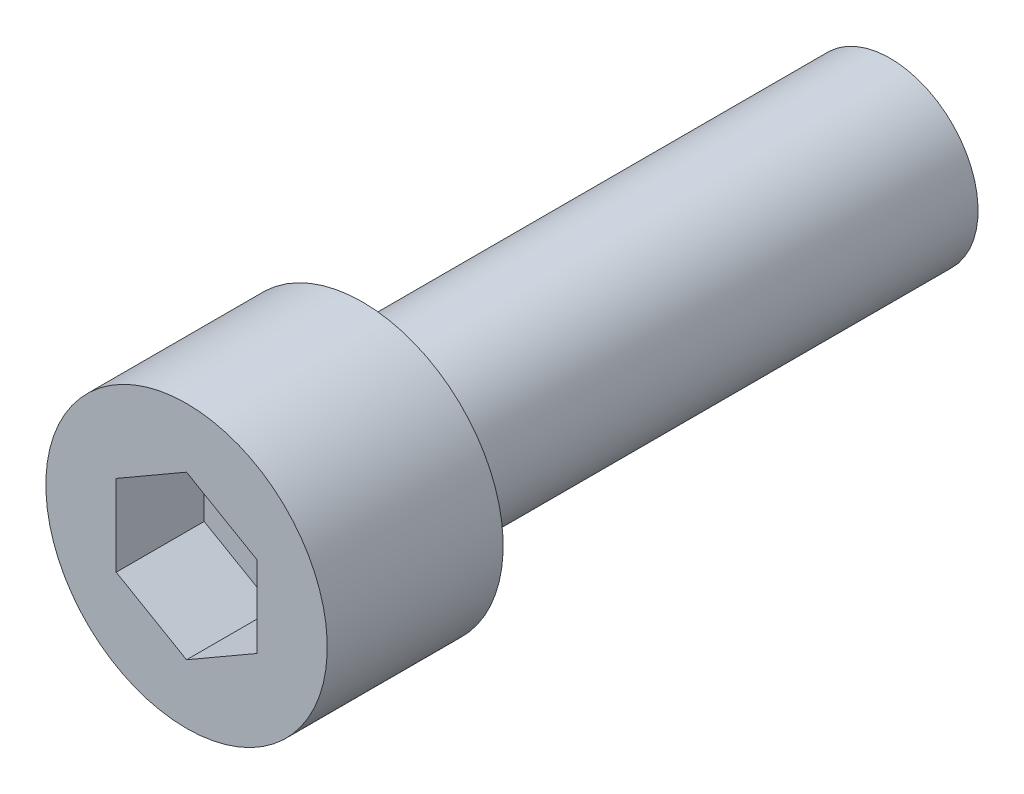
ISO-10303-21;
HEADER;
FILE_DESCRIPTION(('STEP AP214'),'2;1');
FILE_NAME('part.step','',(''),(''),'','','');
FILE_SCHEMA(('AUTOMOTIVE_DESIGN { 1 0 10303 214 1 1 1 1 }'));
ENDSEC;
DATA;
#1=APPLICATION_CONTEXT('core data for automotive mechanical design processes');
#2=APPLICATION_PROTOCOL_DEFINITION('international standard','automotive_design',2000,#1);
#3=PRODUCT_CONTEXT('',#1,'mechanical');
#4=PRODUCT('Part','Part','',(#3));
#5=PRODUCT_RELATED_PRODUCT_CATEGORY('part','',(#4));
#6=PRODUCT_DEFINITION_FORMATION('','',#4);
#7=PRODUCT_DEFINITION_CONTEXT('part definition',#1,'design');
#8=PRODUCT_DEFINITION('design','',#6,#7);
#9=PRODUCT_DEFINITION_SHAPE('','',#8);
#10=(LENGTH_UNIT() NAMED_UNIT(*) SI_UNIT(.MILLI.,.METRE.));
#11=(NAMED_UNIT(*) PLANE_ANGLE_UNIT() SI_UNIT($,.RADIAN.));
#12=(NAMED_UNIT(*) SI_UNIT($,.STERADIAN.) SOLID_ANGLE_UNIT());
#13=UNCERTAINTY_MEASURE_WITH_UNIT(LENGTH_MEASURE(1.E-05),#10,'distance_accuracy_value','');
#14=(GEOMETRIC_REPRESENTATION_CONTEXT(3) GLOBAL_UNCERTAINTY_ASSIGNED_CONTEXT((#13)) GLOBAL_UNIT_ASSIGNED_CONTEXT((#10,
#11,#12)) REPRESENTATION_CONTEXT('',''));
#15=CARTESIAN_POINT('',(0.,0.,0.));
#16=DIRECTION('',(0.,0.,1.));
#17=DIRECTION('',(1.,0.,0.));
#18=AXIS2_PLACEMENT_3D('',#15,#16,#17);
#19=CARTESIAN_POINT('',(0.,0.,0.));
#20=DIRECTION('',(0.,0.,-1.));
#21=DIRECTION('',(0.866025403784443,0.499999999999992,0.));
#22=AXIS2_PLACEMENT_3D('',#19,#20,#21);
#23=CYLINDRICAL_SURFACE('',#22,5.);
#24=CARTESIAN_POINT('',(0.,0.,0.));
#25=DIRECTION('',(0.,0.,1.));
#26=DIRECTION('',(-0.866025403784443,-0.499999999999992,0.));
#27=AXIS2_PLACEMENT_3D('',#24,#25,#26);
#28=CIRCLE('',#27,5.);
#29=CARTESIAN_POINT('',(-4.33012701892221,-2.49999999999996,0.));
#30=VERTEX_POINT('',#29);
#31=EDGE_CURVE('E9',#30,#30,#28,.T.);
#32=ORIENTED_EDGE('',*,*,#31,.F.);
#33=EDGE_LOOP('',(#32));
#34=FACE_BOUND('',#33,.T.);
#35=CARTESIAN_POINT('',(0.,0.,-30.));
#36=DIRECTION('',(0.,0.,1.));
#37=DIRECTION('',(-0.866025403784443,-0.499999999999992,0.));
#38=AXIS2_PLACEMENT_3D('',#35,#36,#37);
#39=CIRCLE('',#38,5.);
#40=CARTESIAN_POINT('',(-4.33012701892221,-2.49999999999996,-30.));
#41=VERTEX_POINT('',#40);
#42=EDGE_CURVE('E22',#41,#41,#39,.T.);
#43=ORIENTED_EDGE('',*,*,#42,.T.);
#44=EDGE_LOOP('',(#43));
#45=FACE_BOUND('',#44,.T.);
#46=ADVANCED_FACE('F15',(#34,#45),#23,.T.);
#47=CARTESIAN_POINT('',(0.,0.,-30.));
#48=DIRECTION('',(0.,0.,1.));
#49=DIRECTION('',(-0.866025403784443,-0.499999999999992,0.));
#50=AXIS2_PLACEMENT_3D('',#47,#48,#49);
#51=PLANE('',#50);
#52=ORIENTED_EDGE('',*,*,#42,.F.);
#53=EDGE_LOOP('',(#52));
#54=FACE_BOUND('',#53,.T.);
#55=ADVANCED_FACE('F132',(#54),#51,.F.);
#56=CARTESIAN_POINT('',(0.,0.,0.));
#57=DIRECTION('',(0.,0.,1.));
#58=DIRECTION('',(-0.866025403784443,-0.499999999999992,0.));
#59=AXIS2_PLACEMENT_3D('',#56,#57,#58);
#60=PLANE('',#59);
#61=CARTESIAN_POINT('',(0.,0.,0.));
#62=DIRECTION('',(0.,0.,1.));
#63=DIRECTION('',(-0.866025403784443,-0.499999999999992,0.));
#64=AXIS2_PLACEMENT_3D('',#61,#62,#63);
#65=CIRCLE('',#64,8.);
#66=CARTESIAN_POINT('',(-6.92820323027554,-3.99999999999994,0.));
#67=VERTEX_POINT('',#66);
#68=EDGE_CURVE('E117',#67,#67,#65,.T.);
#69=ORIENTED_EDGE('',*,*,#68,.F.);
#70=EDGE_LOOP('',(#69));
#71=FACE_BOUND('',#70,.T.);
#72=ORIENTED_EDGE('',*,*,#31,.T.);
#73=EDGE_LOOP('',(#72));
#74=FACE_BOUND('',#73,.T.);
#75=ADVANCED_FACE('F134',(#71,#74),#60,.F.);
#76=CARTESIAN_POINT('',(0.,0.,10.));
#77=DIRECTION('',(0.,0.,-1.));
#78=DIRECTION('',(0.866025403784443,0.499999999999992,0.));
#79=AXIS2_PLACEMENT_3D('',#76,#77,#78);
#80=CYLINDRICAL_SURFACE('',#79,8.);
#81=CARTESIAN_POINT('',(0.,0.,10.));
#82=DIRECTION('',(0.,0.,1.));
#83=DIRECTION('',(-0.866025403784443,-0.499999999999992,0.));
#84=AXIS2_PLACEMENT_3D('',#81,#82,#83);
#85=CIRCLE('',#84,8.);
#86=CARTESIAN_POINT('',(-6.92820323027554,-3.99999999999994,10.));
#87=VERTEX_POINT('',#86);
#88=EDGE_CURVE('E126',#87,#87,#85,.T.);
#89=ORIENTED_EDGE('',*,*,#88,.F.);
#90=EDGE_LOOP('',(#89));
#91=FACE_BOUND('',#90,.T.);
#92=ORIENTED_EDGE('',*,*,#68,.T.);
#93=EDGE_LOOP('',(#92));
#94=FACE_BOUND('',#93,.T.);
#95=ADVANCED_FACE('F141',(#91,#94),#80,.T.);
#96=CARTESIAN_POINT('',(0.,0.,10.));
#97=DIRECTION('',(0.,0.,1.));
#98=DIRECTION('',(-0.866025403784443,-0.499999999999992,0.));
#99=AXIS2_PLACEMENT_3D('',#96,#97,#98);
#100=PLANE('',#99);
#101=DIRECTION('',(0.,-1.,0.));
#102=VECTOR('',#101,1.);
#103=CARTESIAN_POINT('',(-4.,2.30940107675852,10.));
#104=LINE('',#103,#102);
#105=CARTESIAN_POINT('',(-4.,2.30940107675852,10.));
#106=VERTEX_POINT('',#105);
#107=CARTESIAN_POINT('',(-4.,-2.30940107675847,10.));
#108=VERTEX_POINT('',#107);
#109=EDGE_CURVE('E29',#106,#108,#104,.T.);
#110=ORIENTED_EDGE('',*,*,#109,.F.);
#111=DIRECTION('',(-0.86602540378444,-0.5,0.));
#112=VECTOR('',#111,1.);
#113=CARTESIAN_POINT('',(0.,4.61880215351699,10.));
#114=LINE('',#113,#112);
#115=CARTESIAN_POINT('',(0.,4.61880215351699,10.));
#116=VERTEX_POINT('',#115);
#117=EDGE_CURVE('E99',#116,#106,#114,.T.);
#118=ORIENTED_EDGE('',*,*,#117,.F.);
#119=DIRECTION('',(-0.866025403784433,0.5,0.));
#120=VECTOR('',#119,1.);
#121=CARTESIAN_POINT('',(4.,2.30940107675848,10.));
#122=LINE('',#121,#120);
#123=CARTESIAN_POINT('',(4.,2.30940107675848,10.));
#124=VERTEX_POINT('',#123);
#125=EDGE_CURVE('E93',#124,#116,#122,.T.);
#126=ORIENTED_EDGE('',*,*,#125,.F.);
#127=DIRECTION('',(0.,1.,0.));
#128=VECTOR('',#127,1.);
#129=CARTESIAN_POINT('',(4.,-2.30940107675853,10.));
#130=LINE('',#129,#128);
#131=CARTESIAN_POINT('',(4.,-2.30940107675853,10.));
#132=VERTEX_POINT('',#131);
#133=EDGE_CURVE('E91',#132,#124,#130,.T.);
#134=ORIENTED_EDGE('',*,*,#133,.F.);
#135=DIRECTION('',(0.86602540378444,0.5,0.));
#136=VECTOR('',#135,1.);
#137=CARTESIAN_POINT('',(0.,-4.61880215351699,10.));
#138=LINE('',#137,#136);
#139=CARTESIAN_POINT('',(0.,-4.61880215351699,10.));
#140=VERTEX_POINT('',#139);
#141=EDGE_CURVE('E72',#140,#132,#138,.T.);
#142=ORIENTED_EDGE('',*,*,#141,.F.);
#143=DIRECTION('',(0.866025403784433,-0.5,0.));
#144=VECTOR('',#143,1.);
#145=CARTESIAN_POINT('',(-4.,-2.30940107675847,10.));
#146=LINE('',#145,#144);
#147=EDGE_CURVE('E83',#108,#140,#146,.T.);
#148=ORIENTED_EDGE('',*,*,#147,.F.);
#149=EDGE_LOOP('',(#110,#118,#126,#134,#142,#148));
#150=FACE_BOUND('',#149,.T.);
#151=ORIENTED_EDGE('',*,*,#88,.T.);
#152=EDGE_LOOP('',(#151));
#153=FACE_BOUND('',#152,.T.);
#154=ADVANCED_FACE('F87',(#150,#153),#100,.T.);
#155=CARTESIAN_POINT('',(-4.,2.30940107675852,5.));
#156=DIRECTION('',(-1.,0.,0.));
#157=DIRECTION('',(0.,-1.,0.));
#158=AXIS2_PLACEMENT_3D('',#155,#156,#157);
#159=PLANE('',#158);
#160=ORIENTED_EDGE('',*,*,#109,.T.);
#161=DIRECTION('',(0.,0.,1.));
#162=VECTOR('',#161,1.);
#163=CARTESIAN_POINT('',(-4.,-2.30940107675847,5.));
#164=LINE('',#163,#162);
#165=CARTESIAN_POINT('',(-4.,-2.30940107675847,5.));
#166=VERTEX_POINT('',#165);
#167=EDGE_CURVE('E80',#166,#108,#164,.T.);
#168=ORIENTED_EDGE('',*,*,#167,.F.);
#169=DIRECTION('',(0.,-1.,0.));
#170=VECTOR('',#169,1.);
#171=CARTESIAN_POINT('',(-4.,2.30940107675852,5.));
#172=LINE('',#171,#170);
#173=CARTESIAN_POINT('',(-4.,2.30940107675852,5.));
#174=VERTEX_POINT('',#173);
#175=EDGE_CURVE('E101',#174,#166,#172,.T.);
#176=ORIENTED_EDGE('',*,*,#175,.F.);
#177=DIRECTION('',(0.,0.,1.));
#178=VECTOR('',#177,1.);
#179=CARTESIAN_POINT('',(-4.,2.30940107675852,5.));
#180=LINE('',#179,#178);
#181=EDGE_CURVE('E36',#174,#106,#180,.T.);
#182=ORIENTED_EDGE('',*,*,#181,.T.);
#183=EDGE_LOOP('',(#160,#168,#176,#182));
#184=FACE_BOUND('',#183,.T.);
#185=ADVANCED_FACE('F150',(#184),#159,.F.);
#186=CARTESIAN_POINT('',(0.,4.61880215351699,5.));
#187=DIRECTION('',(-0.5,0.86602540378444,0.));
#188=DIRECTION('',(-0.86602540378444,-0.5,0.));
#189=AXIS2_PLACEMENT_3D('',#186,#187,#188);
#190=PLANE('',#189);
#191=ORIENTED_EDGE('',*,*,#117,.T.);
#192=ORIENTED_EDGE('',*,*,#181,.F.);
#193=DIRECTION('',(-0.86602540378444,-0.5,0.));
#194=VECTOR('',#193,1.);
#195=CARTESIAN_POINT('',(0.,4.61880215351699,5.));
#196=LINE('',#195,#194);
#197=CARTESIAN_POINT('',(0.,4.61880215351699,5.));
#198=VERTEX_POINT('',#197);
#199=EDGE_CURVE('E113',#198,#174,#196,.T.);
#200=ORIENTED_EDGE('',*,*,#199,.F.);
#201=DIRECTION('',(0.,0.,1.));
#202=VECTOR('',#201,1.);
#203=CARTESIAN_POINT('',(0.,4.61880215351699,5.));
#204=LINE('',#203,#202);
#205=EDGE_CURVE('E118',#198,#116,#204,.T.);
#206=ORIENTED_EDGE('',*,*,#205,.T.);
#207=EDGE_LOOP('',(#191,#192,#200,#206));
#208=FACE_BOUND('',#207,.T.);
#209=ADVANCED_FACE('F154',(#208),#190,.F.);
#210=CARTESIAN_POINT('',(4.,2.30940107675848,5.));
#211=DIRECTION('',(0.500000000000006,0.866025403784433,0.));
#212=DIRECTION('',(-0.866025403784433,0.5,0.));
#213=AXIS2_PLACEMENT_3D('',#210,#211,#212);
#214=PLANE('',#213);
#215=ORIENTED_EDGE('',*,*,#125,.T.);
#216=ORIENTED_EDGE('',*,*,#205,.F.);
#217=DIRECTION('',(-0.866025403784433,0.5,0.));
#218=VECTOR('',#217,1.);
#219=CARTESIAN_POINT('',(4.,2.30940107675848,5.));
#220=LINE('',#219,#218);
#221=CARTESIAN_POINT('',(4.,2.30940107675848,5.));
#222=VERTEX_POINT('',#221);
#223=EDGE_CURVE('E110',#222,#198,#220,.T.);
#224=ORIENTED_EDGE('',*,*,#223,.F.);
#225=DIRECTION('',(0.,0.,1.));
#226=VECTOR('',#225,1.);
#227=CARTESIAN_POINT('',(4.,2.30940107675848,5.));
#228=LINE('',#227,#226);
#229=EDGE_CURVE('E120',#222,#124,#228,.T.);
#230=ORIENTED_EDGE('',*,*,#229,.T.);
#231=EDGE_LOOP('',(#215,#216,#224,#230));
#232=FACE_BOUND('',#231,.T.);
#233=ADVANCED_FACE('F163',(#232),#214,.F.);
#234=CARTESIAN_POINT('',(4.,-2.30940107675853,5.));
#235=DIRECTION('',(1.,0.,0.));
#236=DIRECTION('',(0.,1.,0.));
#237=AXIS2_PLACEMENT_3D('',#234,#235,#236);
#238=PLANE('',#237);
#239=ORIENTED_EDGE('',*,*,#133,.T.);
#240=ORIENTED_EDGE('',*,*,#229,.F.);
#241=DIRECTION('',(0.,1.,0.));
#242=VECTOR('',#241,1.);
#243=CARTESIAN_POINT('',(4.,-2.30940107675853,5.));
#244=LINE('',#243,#242);
#245=CARTESIAN_POINT('',(4.,-2.30940107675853,5.));
#246=VERTEX_POINT('',#245);
#247=EDGE_CURVE('E107',#246,#222,#244,.T.);
#248=ORIENTED_EDGE('',*,*,#247,.F.);
#249=DIRECTION('',(0.,0.,1.));
#250=VECTOR('',#249,1.);
#251=CARTESIAN_POINT('',(4.,-2.30940107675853,5.));
#252=LINE('',#251,#250);
#253=EDGE_CURVE('E79',#246,#132,#252,.T.);
#254=ORIENTED_EDGE('',*,*,#253,.T.);
#255=EDGE_LOOP('',(#239,#240,#248,#254));
#256=FACE_BOUND('',#255,.T.);
#257=ADVANCED_FACE('F160',(#256),#238,.F.);
#258=CARTESIAN_POINT('',(0.,-4.61880215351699,5.));
#259=DIRECTION('',(0.5,-0.86602540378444,0.));
#260=DIRECTION('',(0.86602540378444,0.5,0.));
#261=AXIS2_PLACEMENT_3D('',#258,#259,#260);
#262=PLANE('',#261);
#263=ORIENTED_EDGE('',*,*,#141,.T.);
#264=ORIENTED_EDGE('',*,*,#253,.F.);
#265=DIRECTION('',(0.86602540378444,0.5,0.));
#266=VECTOR('',#265,1.);
#267=CARTESIAN_POINT('',(0.,-4.61880215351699,5.));
#268=LINE('',#267,#266);
#269=CARTESIAN_POINT('',(0.,-4.61880215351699,5.));
#270=VERTEX_POINT('',#269);
#271=EDGE_CURVE('E75',#270,#246,#268,.T.);
#272=ORIENTED_EDGE('',*,*,#271,.F.);
#273=DIRECTION('',(0.,0.,1.));
#274=VECTOR('',#273,1.);
#275=CARTESIAN_POINT('',(0.,-4.61880215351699,5.));
#276=LINE('',#275,#274);
#277=EDGE_CURVE('E68',#270,#140,#276,.T.);
#278=ORIENTED_EDGE('',*,*,#277,.T.);
#279=EDGE_LOOP('',(#263,#264,#272,#278));
#280=FACE_BOUND('',#279,.T.);
#281=ADVANCED_FACE('F70',(#280),#262,.F.);
#282=CARTESIAN_POINT('',(-4.,-2.30940107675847,5.));
#283=DIRECTION('',(-0.500000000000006,-0.866025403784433,0.));
#284=DIRECTION('',(0.866025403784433,-0.5,0.));
#285=AXIS2_PLACEMENT_3D('',#282,#283,#284);
#286=PLANE('',#285);
#287=ORIENTED_EDGE('',*,*,#147,.T.);
#288=ORIENTED_EDGE('',*,*,#277,.F.);
#289=DIRECTION('',(0.866025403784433,-0.5,0.));
#290=VECTOR('',#289,1.);
#291=CARTESIAN_POINT('',(-4.,-2.30940107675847,5.));
#292=LINE('',#291,#290);
#293=EDGE_CURVE('E104',#166,#270,#292,.T.);
#294=ORIENTED_EDGE('',*,*,#293,.F.);
#295=ORIENTED_EDGE('',*,*,#167,.T.);
#296=EDGE_LOOP('',(#287,#288,#294,#295));
#297=FACE_BOUND('',#296,.T.);
#298=ADVANCED_FACE('F84',(#297),#286,.F.);
#299=CARTESIAN_POINT('',(-4.,-2.30940107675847,5.));
#300=DIRECTION('',(0.,0.,1.));
#301=DIRECTION('',(-0.866025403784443,-0.499999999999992,0.));
#302=AXIS2_PLACEMENT_3D('',#299,#300,#301);
#303=PLANE('',#302);
#304=ORIENTED_EDGE('',*,*,#175,.T.);
#305=ORIENTED_EDGE('',*,*,#293,.T.);
#306=ORIENTED_EDGE('',*,*,#271,.T.);
#307=ORIENTED_EDGE('',*,*,#247,.T.);
#308=ORIENTED_EDGE('',*,*,#223,.T.);
#309=ORIENTED_EDGE('',*,*,#199,.T.);
#310=EDGE_LOOP('',(#304,#305,#306,#307,#308,#309));
#311=FACE_BOUND('',#310,.T.);
#312=ADVANCED_FACE('F157',(#311),#303,.T.);
#313=CLOSED_SHELL('',(#46,#55,#75,#95,#154,#185,#209,#233,#257,#281,#298,#312));
#314=MANIFOLD_SOLID_BREP('B1',#313);
#315=ADVANCED_BREP_SHAPE_REPRESENTATION('',(#18,#314),#14);
#316=SHAPE_DEFINITION_REPRESENTATION(#9,#315);
ENDSEC;
END-ISO-10303-21;
